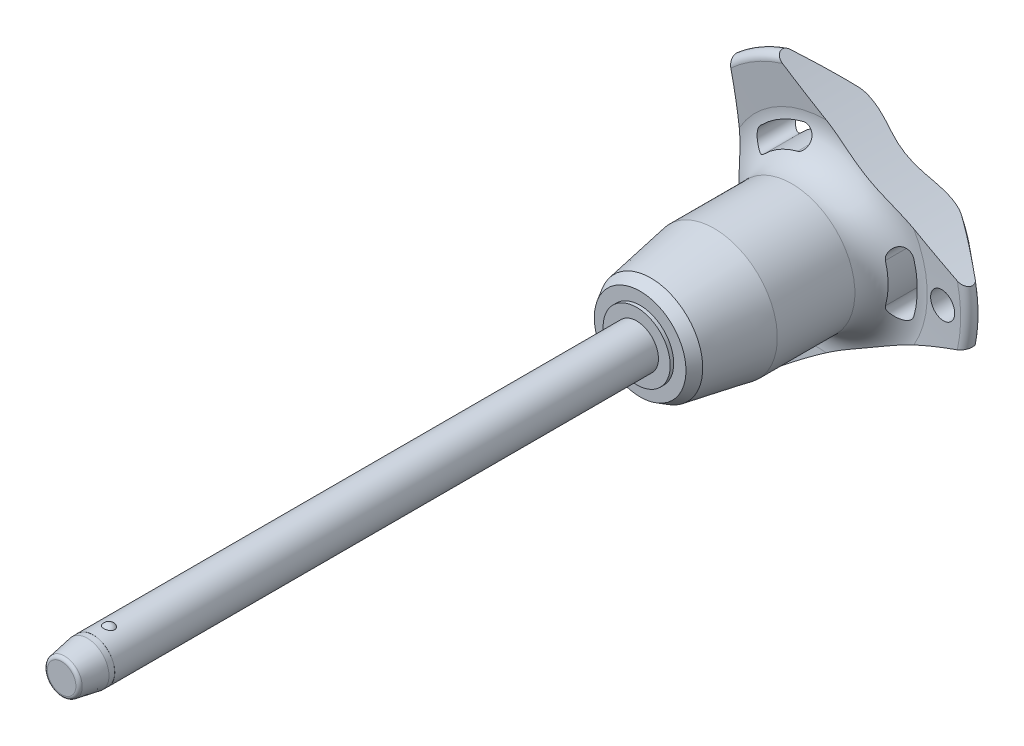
from build123d import *

# Parameters (mm, degrees)
SKETCH1_R           = 2.5
BOSS_EXTRUDE1_DEPTH = 60
SKETCH2_R           = 2.1
BOSS_EXTRUDE2_DEPTH = 26.7
BOSS_EXTRUDE3_START = 6
SKETCH1_2_R         = 2.5
BOSS_EXTRUDE3_DEPTH = 6
CHAMFER1_SIZE       = 3
CHAMFER1_SIZE2      = 0.528980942
FILLET1_R           = 0.4
SKETCH6_R           = 79.96
CUT_EXTRUDE1_DEPTH  = 90.822819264
CIRPATTERN1_COUNT   = 3
SKETCH7_R           = 1.5
CUT_EXTRUDE2_DEPTH  = 90.653203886
SKETCH8_R           = 2.5
SKETCH8_R_2         = 2.49
CUT_EXTRUDE3_DEPTH  = 3.6


with BuildPart() as part:
    # Sketch1 → Boss-Extrude1 (new body)
    with BuildSketch(Plane.XY):
        Circle(SKETCH1_R)
    extrude(amount=-BOSS_EXTRUDE1_DEPTH)

    # Sketch2 → Boss-Extrude2 (add)
    with BuildSketch(Plane(origin=(0, 0, -60), x_dir=(-1, 0, 0), z_dir=(0, 0, -1))):
        Circle(SKETCH2_R)
    extrude(amount=BOSS_EXTRUDE2_DEPTH)

    # Sketch3 → Revolve1 (revolve)
    with BuildSketch(Plane(origin=(0, 0, 0), x_dir=(0, 0, -1), z_dir=(1, 0, 0))):
        with BuildLine():
            Line((-0.580947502, 2.75), (-0.580947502, 1.15))
            ThreePointArc((-0.580947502, 1.15), (0.219052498, 1.95), (-0.580947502, 2.75))
        make_face()
        with BuildLine():
            Line((-0.580947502, -1.15), (-0.580947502, -2.75))
            ThreePointArc((-0.580947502, -2.75), (0.219052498, -1.95), (-0.580947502, -1.15))
        make_face()
    revolve(axis=Axis((0, -1.15, 0.580947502), (0, 1, 0)))

    # Sketch1_2 → Boss-Extrude3 (add)
    with BuildSketch(Plane.XY.offset(BOSS_EXTRUDE3_START)):
        Circle(SKETCH1_2_R)
    extrude(amount=-BOSS_EXTRUDE3_DEPTH)

    # Chamfer1
    chamfer1_edges = [part.edges().sort_by_distance(p)[0] for p in [
        (-2.5, 0, 6),
    ]]
    chamfer1_side = [part.faces().sort_by_distance(p)[0] for p in [
        (-2.5, 0, -27),
    ]]
    chamfer(chamfer1_edges, length=CHAMFER1_SIZE, length2=CHAMFER1_SIZE2, reference=chamfer1_side[0])

    # Fillet1
    fillet1_edges = [part.edges().sort_by_distance(p)[0] for p in [
        (-1.971019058, 0, 6),
        (2.1, 0, -86.7),
    ]]
    fillet(fillet1_edges, radius=FILLET1_R)

    # Sketch4 → Revolve2 (revolve)
    with BuildSketch(Plane(origin=(0, 0, 0), x_dir=(0, 0, -1), z_dir=(1, 0, 0)), mode=Mode.PRIVATE) as revolve2_sk:
        Polygon((60, 0), (60, 3.851837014), (60.4, 3.851837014), (60.4, 5.26161122), (61.620900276, 5.966498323), (68.9, 7.25), (77.8, 7.25), (77.8, 0), align=None)
    revolve(revolve2_sk.sketch.rotate(Axis((0, 0, -77.8), (0, 0, 1)), 90), axis=Axis((0, 0, -77.8), (0, 0, 1)))

    # Sketch5 → Revolve3 (revolve)
    with BuildSketch(Plane(origin=(0, 0, 0), x_dir=(0, 0, -1), z_dir=(1, 0, 0)), mode=Mode.PRIVATE) as revolve3_sk:
        with BuildLine():
            Line((81.78715932, 11.570250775), (81.452568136, 15.735949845))
            ThreePointArc((81.452568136, 15.735949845), (81.946485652, 16.540188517), (82.862835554, 16.314230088))
            Line((82.862835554, 16.314230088), (86.326414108, 12.186497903))
            ThreePointArc((86.326414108, 12.186497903), (86.7, 11.109282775), (86.261488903, 10.056825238))
            ThreePointArc((86.261488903, 10.056825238), (83.289873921, 5.413681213), (82.25, 0))
            Line((82.25, 0), (77.8, 0))
            Line((77.8, 0), (77.8, 7.25))
            ThreePointArc((77.8, 7.25), (80.739473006, 8.537160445), (81.78715932, 11.570250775))
        make_face()
    revolve(revolve3_sk.sketch.rotate(Axis((0, 0, -82.25), (0, 0, 1)), 90), axis=Axis((0, 0, -82.25), (0, 0, 1)))

    # Sketch6 → Cut-Extrude1 (cut, through all)
    with BuildSketch(Plane.XY):
        with Locations((-89.76, 0)):
            Circle(SKETCH6_R)
        with BuildLine():
            ThreePointArc((10.099921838, -2.834717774), (10.490188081, 0), (10.099921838, 2.834717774))
            ThreePointArc((10.099921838, 2.834717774), (8.768180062, 3.582738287), (8.020159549, 2.250996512))
            ThreePointArc((8.020159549, 2.250996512), (8.330062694, 0), (8.020159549, -2.250996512))
            ThreePointArc((8.020159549, -2.250996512), (8.768180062, -3.582738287), (10.099921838, -2.834717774))
        make_face()
    cut_extrude1 = extrude(amount=-CUT_EXTRUDE1_DEPTH, mode=Mode.SUBTRACT)

    # CirPattern1: Cut-Extrude1 ×3 about axis
    cirpattern1_axis = Axis((0, 0, 0), (0, 0, 1))
    for i in range(1, CIRPATTERN1_COUNT):
        add(cut_extrude1.rotate(cirpattern1_axis, i * 360 / CIRPATTERN1_COUNT), mode=Mode.SUBTRACT)

    # Sketch7 → Cut-Extrude2 (cut, through all)
    with BuildSketch(Plane.XY):
        with Locations(Location((13.490188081, 0, 0), (0, 0, 225.221865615))):
            Circle(SKETCH7_R)
    extrude(amount=-CUT_EXTRUDE2_DEPTH, mode=Mode.SUBTRACT)

    # Sketch8 → Cut-Extrude3 (cut)
    with BuildSketch(Plane.XY.offset(6)):
        Circle(SKETCH8_R)
        Circle(SKETCH8_R_2, mode=Mode.SUBTRACT)
    extrude(amount=-CUT_EXTRUDE3_DEPTH, mode=Mode.SUBTRACT)


solid = part.part
